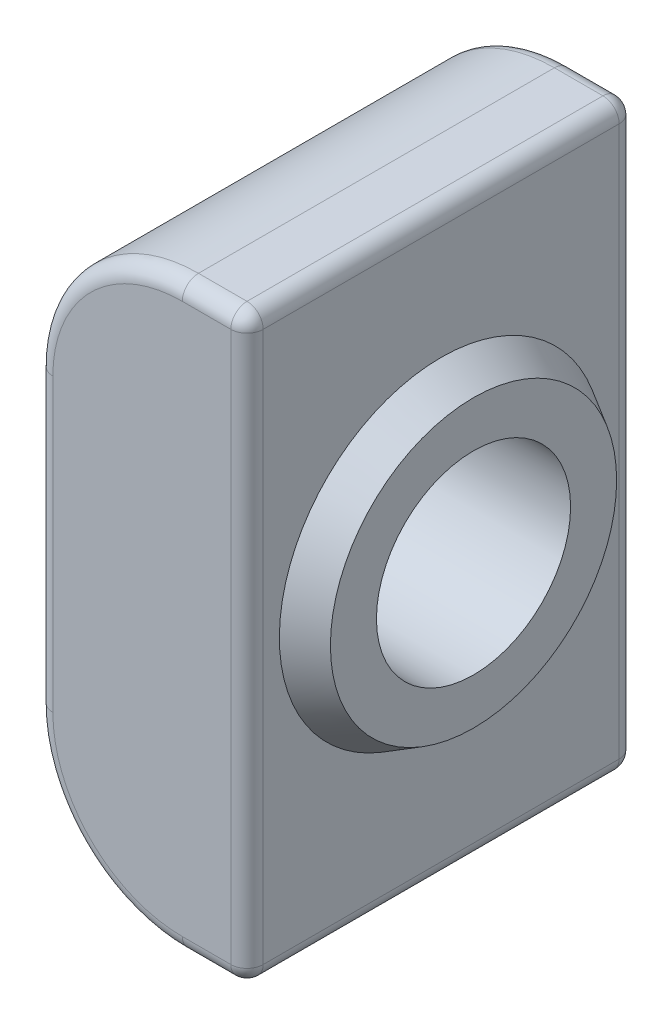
ISO-10303-21;
HEADER;
FILE_DESCRIPTION(('STEP AP214'),'2;1');
FILE_NAME('part.step','',(''),(''),'','','');
FILE_SCHEMA(('AUTOMOTIVE_DESIGN { 1 0 10303 214 1 1 1 1 }'));
ENDSEC;
DATA;
#1=APPLICATION_CONTEXT('core data for automotive mechanical design processes');
#2=APPLICATION_PROTOCOL_DEFINITION('international standard','automotive_design',2000,#1);
#3=PRODUCT_CONTEXT('',#1,'mechanical');
#4=PRODUCT('Part','Part','',(#3));
#5=PRODUCT_RELATED_PRODUCT_CATEGORY('part','',(#4));
#6=PRODUCT_DEFINITION_FORMATION('','',#4);
#7=PRODUCT_DEFINITION_CONTEXT('part definition',#1,'design');
#8=PRODUCT_DEFINITION('design','',#6,#7);
#9=PRODUCT_DEFINITION_SHAPE('','',#8);
#10=(LENGTH_UNIT() NAMED_UNIT(*) SI_UNIT(.MILLI.,.METRE.));
#11=(NAMED_UNIT(*) PLANE_ANGLE_UNIT() SI_UNIT($,.RADIAN.));
#12=(NAMED_UNIT(*) SI_UNIT($,.STERADIAN.) SOLID_ANGLE_UNIT());
#13=UNCERTAINTY_MEASURE_WITH_UNIT(LENGTH_MEASURE(1.E-05),#10,'distance_accuracy_value','');
#14=(GEOMETRIC_REPRESENTATION_CONTEXT(3) GLOBAL_UNCERTAINTY_ASSIGNED_CONTEXT((#13)) GLOBAL_UNIT_ASSIGNED_CONTEXT((#10,
#11,#12)) REPRESENTATION_CONTEXT('',''));
#15=CARTESIAN_POINT('',(0.,0.,0.));
#16=DIRECTION('',(0.,0.,1.));
#17=DIRECTION('',(1.,0.,0.));
#18=AXIS2_PLACEMENT_3D('',#15,#16,#17);
#19=CARTESIAN_POINT('',(0.,9.,6.));
#20=DIRECTION('',(-1.,0.,0.));
#21=DIRECTION('',(0.,0.,1.));
#22=AXIS2_PLACEMENT_3D('',#19,#20,#21);
#23=PLANE('',#22);
#24=DIRECTION('',(0.,1.,0.));
#25=VECTOR('',#24,1.);
#26=CARTESIAN_POINT('',(0.,9.,5.5));
#27=LINE('',#26,#25);
#28=CARTESIAN_POINT('',(0.,8.5,5.5));
#29=VERTEX_POINT('',#28);
#30=CARTESIAN_POINT('',(0.,-8.5,5.5));
#31=VERTEX_POINT('',#30);
#32=EDGE_CURVE('E205',#29,#31,#27,.F.);
#33=ORIENTED_EDGE('',*,*,#32,.T.);
#34=DIRECTION('',(0.,0.,-1.));
#35=VECTOR('',#34,1.);
#36=CARTESIAN_POINT('',(0.,-8.5,6.));
#37=LINE('',#36,#35);
#38=CARTESIAN_POINT('',(0.,-8.5,-5.5));
#39=VERTEX_POINT('',#38);
#40=EDGE_CURVE('E210',#31,#39,#37,.T.);
#41=ORIENTED_EDGE('',*,*,#40,.T.);
#42=DIRECTION('',(0.,1.,0.));
#43=VECTOR('',#42,1.);
#44=CARTESIAN_POINT('',(0.,9.,-5.5));
#45=LINE('',#44,#43);
#46=CARTESIAN_POINT('',(0.,8.5,-5.5));
#47=VERTEX_POINT('',#46);
#48=EDGE_CURVE('E207',#39,#47,#45,.T.);
#49=ORIENTED_EDGE('',*,*,#48,.T.);
#50=DIRECTION('',(0.,0.,-1.));
#51=VECTOR('',#50,1.);
#52=CARTESIAN_POINT('',(0.,8.5,6.));
#53=LINE('',#52,#51);
#54=EDGE_CURVE('E203',#47,#29,#53,.F.);
#55=ORIENTED_EDGE('',*,*,#54,.T.);
#56=EDGE_LOOP('',(#33,#41,#49,#55));
#57=FACE_BOUND('',#56,.T.);
#58=CARTESIAN_POINT('',(0.,0.,0.));
#59=DIRECTION('',(1.,0.,0.));
#60=DIRECTION('',(0.,1.,0.));
#61=AXIS2_PLACEMENT_3D('',#58,#59,#60);
#62=CIRCLE('',#61,5.);
#63=CARTESIAN_POINT('',(0.,5.,0.));
#64=VERTEX_POINT('',#63);
#65=EDGE_CURVE('E155',#64,#64,#62,.T.);
#66=ORIENTED_EDGE('',*,*,#65,.F.);
#67=EDGE_LOOP('',(#66));
#68=FACE_BOUND('',#67,.T.);
#69=ADVANCED_FACE('F33',(#57,#68),#23,.F.);
#70=CARTESIAN_POINT('',(0.,9.,6.));
#71=DIRECTION('',(0.,-1.,0.));
#72=DIRECTION('',(0.,0.,-1.));
#73=AXIS2_PLACEMENT_3D('',#70,#71,#72);
#74=PLANE('',#73);
#75=DIRECTION('',(0.,0.,-1.));
#76=VECTOR('',#75,1.);
#77=CARTESIAN_POINT('',(-0.499999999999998,9.,6.));
#78=LINE('',#77,#76);
#79=CARTESIAN_POINT('',(-0.499999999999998,9.,5.5));
#80=VERTEX_POINT('',#79);
#81=CARTESIAN_POINT('',(-0.499999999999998,9.,-5.5));
#82=VERTEX_POINT('',#81);
#83=EDGE_CURVE('E171',#80,#82,#78,.T.);
#84=ORIENTED_EDGE('',*,*,#83,.T.);
#85=DIRECTION('',(-1.,0.,0.));
#86=VECTOR('',#85,1.);
#87=CARTESIAN_POINT('',(-2.,9.,-5.5));
#88=LINE('',#87,#86);
#89=CARTESIAN_POINT('',(-2.,9.,-5.5));
#90=VERTEX_POINT('',#89);
#91=EDGE_CURVE('E154',#82,#90,#88,.T.);
#92=ORIENTED_EDGE('',*,*,#91,.T.);
#93=DIRECTION('',(0.,0.,-1.));
#94=VECTOR('',#93,1.);
#95=CARTESIAN_POINT('',(-2.,9.,6.));
#96=LINE('',#95,#94);
#97=CARTESIAN_POINT('',(-2.,9.,5.5));
#98=VERTEX_POINT('',#97);
#99=EDGE_CURVE('E137',#98,#90,#96,.T.);
#100=ORIENTED_EDGE('',*,*,#99,.F.);
#101=DIRECTION('',(-1.,0.,0.));
#102=VECTOR('',#101,1.);
#103=CARTESIAN_POINT('',(0.,9.,5.5));
#104=LINE('',#103,#102);
#105=EDGE_CURVE('E151',#98,#80,#104,.F.);
#106=ORIENTED_EDGE('',*,*,#105,.T.);
#107=EDGE_LOOP('',(#84,#92,#100,#106));
#108=FACE_BOUND('',#107,.T.);
#109=ADVANCED_FACE('F149',(#108),#74,.F.);
#110=CARTESIAN_POINT('',(-2.,4.5,6.));
#111=DIRECTION('',(0.,0.,-1.));
#112=DIRECTION('',(-1.,0.,0.));
#113=AXIS2_PLACEMENT_3D('',#110,#111,#112);
#114=CYLINDRICAL_SURFACE('',#113,4.5);
#115=ORIENTED_EDGE('',*,*,#99,.T.);
#116=CARTESIAN_POINT('',(-2.,4.5,-5.5));
#117=DIRECTION('',(0.,0.,-1.));
#118=DIRECTION('',(-1.,0.,0.));
#119=AXIS2_PLACEMENT_3D('',#116,#117,#118);
#120=CIRCLE('',#119,4.5);
#121=CARTESIAN_POINT('',(-6.5,4.5,-5.5));
#122=VERTEX_POINT('',#121);
#123=EDGE_CURVE('E144',#90,#122,#120,.F.);
#124=ORIENTED_EDGE('',*,*,#123,.T.);
#125=DIRECTION('',(0.,0.,-1.));
#126=VECTOR('',#125,1.);
#127=CARTESIAN_POINT('',(-6.5,4.5,6.));
#128=LINE('',#127,#126);
#129=CARTESIAN_POINT('',(-6.5,4.5,5.5));
#130=VERTEX_POINT('',#129);
#131=EDGE_CURVE('E139',#130,#122,#128,.T.);
#132=ORIENTED_EDGE('',*,*,#131,.F.);
#133=CARTESIAN_POINT('',(-2.,4.5,5.5));
#134=DIRECTION('',(0.,0.,-1.));
#135=DIRECTION('',(-1.,0.,0.));
#136=AXIS2_PLACEMENT_3D('',#133,#134,#135);
#137=CIRCLE('',#136,4.5);
#138=EDGE_CURVE('E134',#130,#98,#137,.T.);
#139=ORIENTED_EDGE('',*,*,#138,.T.);
#140=EDGE_LOOP('',(#115,#124,#132,#139));
#141=FACE_BOUND('',#140,.T.);
#142=ADVANCED_FACE('F136',(#141),#114,.T.);
#143=CARTESIAN_POINT('',(-6.5,4.5,6.));
#144=DIRECTION('',(1.,0.,0.));
#145=DIRECTION('',(0.,0.,-1.));
#146=AXIS2_PLACEMENT_3D('',#143,#144,#145);
#147=PLANE('',#146);
#148=CARTESIAN_POINT('',(-6.5,0.,0.));
#149=DIRECTION('',(1.,0.,0.));
#150=DIRECTION('',(0.,1.,0.));
#151=AXIS2_PLACEMENT_3D('',#148,#149,#150);
#152=CIRCLE('',#151,3.);
#153=CARTESIAN_POINT('',(-6.5,3.,0.));
#154=VERTEX_POINT('',#153);
#155=EDGE_CURVE('E272',#154,#154,#152,.T.);
#156=ORIENTED_EDGE('',*,*,#155,.T.);
#157=EDGE_LOOP('',(#156));
#158=FACE_BOUND('',#157,.T.);
#159=ORIENTED_EDGE('',*,*,#131,.T.);
#160=DIRECTION('',(0.,-1.,0.));
#161=VECTOR('',#160,1.);
#162=CARTESIAN_POINT('',(-6.5,-4.5,-5.5));
#163=LINE('',#162,#161);
#164=CARTESIAN_POINT('',(-6.5,-4.5,-5.5));
#165=VERTEX_POINT('',#164);
#166=EDGE_CURVE('E191',#122,#165,#163,.T.);
#167=ORIENTED_EDGE('',*,*,#166,.T.);
#168=DIRECTION('',(0.,0.,-1.));
#169=VECTOR('',#168,1.);
#170=CARTESIAN_POINT('',(-6.5,-4.5,6.));
#171=LINE('',#170,#169);
#172=CARTESIAN_POINT('',(-6.5,-4.5,5.5));
#173=VERTEX_POINT('',#172);
#174=EDGE_CURVE('E287',#173,#165,#171,.T.);
#175=ORIENTED_EDGE('',*,*,#174,.F.);
#176=DIRECTION('',(0.,-1.,0.));
#177=VECTOR('',#176,1.);
#178=CARTESIAN_POINT('',(-6.5,4.5,5.5));
#179=LINE('',#178,#177);
#180=EDGE_CURVE('E189',#173,#130,#179,.F.);
#181=ORIENTED_EDGE('',*,*,#180,.T.);
#182=EDGE_LOOP('',(#159,#167,#175,#181));
#183=FACE_BOUND('',#182,.T.);
#184=ADVANCED_FACE('F292',(#158,#183),#147,.F.);
#185=CARTESIAN_POINT('',(-2.,-4.5,6.));
#186=DIRECTION('',(0.,0.,-1.));
#187=DIRECTION('',(-1.,0.,0.));
#188=AXIS2_PLACEMENT_3D('',#185,#186,#187);
#189=CYLINDRICAL_SURFACE('',#188,4.5);
#190=ORIENTED_EDGE('',*,*,#174,.T.);
#191=CARTESIAN_POINT('',(-2.,-4.5,-5.5));
#192=DIRECTION('',(0.,0.,-1.));
#193=DIRECTION('',(-1.,0.,0.));
#194=AXIS2_PLACEMENT_3D('',#191,#192,#193);
#195=CIRCLE('',#194,4.5);
#196=CARTESIAN_POINT('',(-2.,-9.,-5.5));
#197=VERTEX_POINT('',#196);
#198=EDGE_CURVE('E195',#165,#197,#195,.F.);
#199=ORIENTED_EDGE('',*,*,#198,.T.);
#200=DIRECTION('',(0.,0.,-1.));
#201=VECTOR('',#200,1.);
#202=CARTESIAN_POINT('',(-2.,-9.,6.));
#203=LINE('',#202,#201);
#204=CARTESIAN_POINT('',(-2.,-9.,5.5));
#205=VERTEX_POINT('',#204);
#206=EDGE_CURVE('E284',#205,#197,#203,.T.);
#207=ORIENTED_EDGE('',*,*,#206,.F.);
#208=CARTESIAN_POINT('',(-2.,-4.5,5.5));
#209=DIRECTION('',(0.,0.,-1.));
#210=DIRECTION('',(-1.,0.,0.));
#211=AXIS2_PLACEMENT_3D('',#208,#209,#210);
#212=CIRCLE('',#211,4.5);
#213=EDGE_CURVE('E193',#205,#173,#212,.T.);
#214=ORIENTED_EDGE('',*,*,#213,.T.);
#215=EDGE_LOOP('',(#190,#199,#207,#214));
#216=FACE_BOUND('',#215,.T.);
#217=ADVANCED_FACE('F552',(#216),#189,.T.);
#218=CARTESIAN_POINT('',(0.,-9.,6.));
#219=DIRECTION('',(0.,1.,0.));
#220=DIRECTION('',(0.,0.,1.));
#221=AXIS2_PLACEMENT_3D('',#218,#219,#220);
#222=PLANE('',#221);
#223=ORIENTED_EDGE('',*,*,#206,.T.);
#224=DIRECTION('',(1.,0.,0.));
#225=VECTOR('',#224,1.);
#226=CARTESIAN_POINT('',(0.,-9.,-5.5));
#227=LINE('',#226,#225);
#228=CARTESIAN_POINT('',(-0.499999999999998,-9.,-5.5));
#229=VERTEX_POINT('',#228);
#230=EDGE_CURVE('E201',#197,#229,#227,.T.);
#231=ORIENTED_EDGE('',*,*,#230,.T.);
#232=DIRECTION('',(0.,0.,-1.));
#233=VECTOR('',#232,1.);
#234=CARTESIAN_POINT('',(-0.499999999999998,-9.,6.));
#235=LINE('',#234,#233);
#236=CARTESIAN_POINT('',(-0.499999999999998,-9.,5.5));
#237=VERTEX_POINT('',#236);
#238=EDGE_CURVE('E197',#229,#237,#235,.F.);
#239=ORIENTED_EDGE('',*,*,#238,.T.);
#240=DIRECTION('',(1.,0.,0.));
#241=VECTOR('',#240,1.);
#242=CARTESIAN_POINT('',(0.,-9.,5.5));
#243=LINE('',#242,#241);
#244=EDGE_CURVE('E199',#237,#205,#243,.F.);
#245=ORIENTED_EDGE('',*,*,#244,.T.);
#246=EDGE_LOOP('',(#223,#231,#239,#245));
#247=FACE_BOUND('',#246,.T.);
#248=ADVANCED_FACE('F336',(#247),#222,.F.);
#249=CARTESIAN_POINT('',(-2.,-4.5,6.));
#250=DIRECTION('',(0.,0.,-1.));
#251=DIRECTION('',(-1.,0.,0.));
#252=AXIS2_PLACEMENT_3D('',#249,#250,#251);
#253=PLANE('',#252);
#254=CARTESIAN_POINT('',(-2.,-4.5,6.));
#255=DIRECTION('',(0.,0.,-1.));
#256=DIRECTION('',(-1.,0.,0.));
#257=AXIS2_PLACEMENT_3D('',#254,#255,#256);
#258=CIRCLE('',#257,4.);
#259=CARTESIAN_POINT('',(-5.99999999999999,-4.5,6.));
#260=VERTEX_POINT('',#259);
#261=CARTESIAN_POINT('',(-2.,-8.5,6.));
#262=VERTEX_POINT('',#261);
#263=EDGE_CURVE('E42',#260,#262,#258,.F.);
#264=ORIENTED_EDGE('',*,*,#263,.T.);
#265=DIRECTION('',(1.,0.,0.));
#266=VECTOR('',#265,1.);
#267=CARTESIAN_POINT('',(-2.,-8.5,6.));
#268=LINE('',#267,#266);
#269=CARTESIAN_POINT('',(-0.499999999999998,-8.5,6.));
#270=VERTEX_POINT('',#269);
#271=EDGE_CURVE('E11',#262,#270,#268,.T.);
#272=ORIENTED_EDGE('',*,*,#271,.T.);
#273=DIRECTION('',(0.,1.,0.));
#274=VECTOR('',#273,1.);
#275=CARTESIAN_POINT('',(-0.499999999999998,-4.5,6.));
#276=LINE('',#275,#274);
#277=CARTESIAN_POINT('',(-0.499999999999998,8.5,6.));
#278=VERTEX_POINT('',#277);
#279=EDGE_CURVE('E212',#270,#278,#276,.T.);
#280=ORIENTED_EDGE('',*,*,#279,.T.);
#281=DIRECTION('',(-1.,0.,0.));
#282=VECTOR('',#281,1.);
#283=CARTESIAN_POINT('',(-2.,8.5,6.));
#284=LINE('',#283,#282);
#285=CARTESIAN_POINT('',(-2.,8.5,6.));
#286=VERTEX_POINT('',#285);
#287=EDGE_CURVE('E214',#278,#286,#284,.T.);
#288=ORIENTED_EDGE('',*,*,#287,.T.);
#289=CARTESIAN_POINT('',(-2.,4.5,6.));
#290=DIRECTION('',(0.,0.,-1.));
#291=DIRECTION('',(-1.,0.,0.));
#292=AXIS2_PLACEMENT_3D('',#289,#290,#291);
#293=CIRCLE('',#292,4.);
#294=CARTESIAN_POINT('',(-5.99999999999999,4.5,6.));
#295=VERTEX_POINT('',#294);
#296=EDGE_CURVE('E161',#286,#295,#293,.F.);
#297=ORIENTED_EDGE('',*,*,#296,.T.);
#298=DIRECTION('',(0.,-1.,0.));
#299=VECTOR('',#298,1.);
#300=CARTESIAN_POINT('',(-5.99999999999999,-4.5,6.));
#301=LINE('',#300,#299);
#302=EDGE_CURVE('E53',#295,#260,#301,.T.);
#303=ORIENTED_EDGE('',*,*,#302,.T.);
#304=EDGE_LOOP('',(#264,#272,#280,#288,#297,#303));
#305=FACE_BOUND('',#304,.T.);
#306=ADVANCED_FACE('F347',(#305),#253,.F.);
#307=CARTESIAN_POINT('',(-2.,-4.5,-6.));
#308=DIRECTION('',(0.,0.,-1.));
#309=DIRECTION('',(-1.,0.,0.));
#310=AXIS2_PLACEMENT_3D('',#307,#308,#309);
#311=PLANE('',#310);
#312=CARTESIAN_POINT('',(-2.,4.5,-6.));
#313=DIRECTION('',(0.,0.,-1.));
#314=DIRECTION('',(-1.,0.,0.));
#315=AXIS2_PLACEMENT_3D('',#312,#313,#314);
#316=CIRCLE('',#315,4.);
#317=CARTESIAN_POINT('',(-5.99999999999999,4.5,-6.));
#318=VERTEX_POINT('',#317);
#319=CARTESIAN_POINT('',(-2.,8.5,-6.));
#320=VERTEX_POINT('',#319);
#321=EDGE_CURVE('E184',#318,#320,#316,.T.);
#322=ORIENTED_EDGE('',*,*,#321,.T.);
#323=DIRECTION('',(-1.,0.,0.));
#324=VECTOR('',#323,1.);
#325=CARTESIAN_POINT('',(0.,8.5,-6.));
#326=LINE('',#325,#324);
#327=CARTESIAN_POINT('',(-0.499999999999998,8.5,-6.));
#328=VERTEX_POINT('',#327);
#329=EDGE_CURVE('E145',#320,#328,#326,.F.);
#330=ORIENTED_EDGE('',*,*,#329,.T.);
#331=DIRECTION('',(0.,1.,0.));
#332=VECTOR('',#331,1.);
#333=CARTESIAN_POINT('',(-0.499999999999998,-9.,-6.));
#334=LINE('',#333,#332);
#335=CARTESIAN_POINT('',(-0.499999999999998,-8.5,-6.));
#336=VERTEX_POINT('',#335);
#337=EDGE_CURVE('E173',#328,#336,#334,.F.);
#338=ORIENTED_EDGE('',*,*,#337,.T.);
#339=DIRECTION('',(1.,0.,0.));
#340=VECTOR('',#339,1.);
#341=CARTESIAN_POINT('',(-2.,-8.5,-6.));
#342=LINE('',#341,#340);
#343=CARTESIAN_POINT('',(-2.,-8.5,-6.));
#344=VERTEX_POINT('',#343);
#345=EDGE_CURVE('E178',#336,#344,#342,.F.);
#346=ORIENTED_EDGE('',*,*,#345,.T.);
#347=CARTESIAN_POINT('',(-2.,-4.5,-6.));
#348=DIRECTION('',(0.,0.,-1.));
#349=DIRECTION('',(-1.,0.,0.));
#350=AXIS2_PLACEMENT_3D('',#347,#348,#349);
#351=CIRCLE('',#350,4.);
#352=CARTESIAN_POINT('',(-5.99999999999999,-4.5,-6.));
#353=VERTEX_POINT('',#352);
#354=EDGE_CURVE('E180',#344,#353,#351,.T.);
#355=ORIENTED_EDGE('',*,*,#354,.T.);
#356=DIRECTION('',(0.,-1.,0.));
#357=VECTOR('',#356,1.);
#358=CARTESIAN_POINT('',(-5.99999999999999,4.5,-6.));
#359=LINE('',#358,#357);
#360=EDGE_CURVE('E182',#353,#318,#359,.F.);
#361=ORIENTED_EDGE('',*,*,#360,.T.);
#362=EDGE_LOOP('',(#322,#330,#338,#346,#355,#361));
#363=FACE_BOUND('',#362,.T.);
#364=ADVANCED_FACE('F306',(#363),#311,.T.);
#365=CARTESIAN_POINT('',(0.,0.,0.));
#366=DIRECTION('',(-1.,0.,0.));
#367=DIRECTION('',(0.,1.,0.));
#368=AXIS2_PLACEMENT_3D('',#365,#366,#367);
#369=CONICAL_SURFACE('',#368,5.,0.5235987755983);
#370=CARTESIAN_POINT('',(1.,0.,0.));
#371=DIRECTION('',(1.,0.,0.));
#372=DIRECTION('',(0.,1.,0.));
#373=AXIS2_PLACEMENT_3D('',#370,#371,#372);
#374=CIRCLE('',#373,4.42264973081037);
#375=CARTESIAN_POINT('',(1.,4.42264973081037,0.));
#376=VERTEX_POINT('',#375);
#377=EDGE_CURVE('E277',#376,#376,#374,.T.);
#378=ORIENTED_EDGE('',*,*,#377,.F.);
#379=EDGE_LOOP('',(#378));
#380=FACE_BOUND('',#379,.T.);
#381=ORIENTED_EDGE('',*,*,#65,.T.);
#382=EDGE_LOOP('',(#381));
#383=FACE_BOUND('',#382,.T.);
#384=ADVANCED_FACE('F522',(#380,#383),#369,.T.);
#385=CARTESIAN_POINT('',(1.,0.,0.));
#386=DIRECTION('',(1.,0.,0.));
#387=DIRECTION('',(0.,1.,0.));
#388=AXIS2_PLACEMENT_3D('',#385,#386,#387);
#389=PLANE('',#388);
#390=CARTESIAN_POINT('',(1.,0.,0.));
#391=DIRECTION('',(1.,0.,0.));
#392=DIRECTION('',(0.,1.,0.));
#393=AXIS2_PLACEMENT_3D('',#390,#391,#392);
#394=CIRCLE('',#393,3.);
#395=CARTESIAN_POINT('',(1.,3.,0.));
#396=VERTEX_POINT('',#395);
#397=EDGE_CURVE('E267',#396,#396,#394,.T.);
#398=ORIENTED_EDGE('',*,*,#397,.F.);
#399=EDGE_LOOP('',(#398));
#400=FACE_BOUND('',#399,.T.);
#401=ORIENTED_EDGE('',*,*,#377,.T.);
#402=EDGE_LOOP('',(#401));
#403=FACE_BOUND('',#402,.T.);
#404=ADVANCED_FACE('F513',(#400,#403),#389,.T.);
#405=CARTESIAN_POINT('',(-6.5,0.,0.));
#406=DIRECTION('',(1.,0.,0.));
#407=DIRECTION('',(0.,1.,0.));
#408=AXIS2_PLACEMENT_3D('',#405,#406,#407);
#409=CYLINDRICAL_SURFACE('',#408,3.);
#410=CARTESIAN_POINT('',(-6.5,3.,0.));
#411=CARTESIAN_POINT('',(-6.421875,3.,0.));
#412=CARTESIAN_POINT('',(-6.34375,3.,0.));
#413=CARTESIAN_POINT('',(-6.1875,3.,0.));
#414=CARTESIAN_POINT('',(-6.109375,3.,0.));
#415=CARTESIAN_POINT('',(-5.953125,3.,0.));
#416=CARTESIAN_POINT('',(-5.875,3.,0.));
#417=CARTESIAN_POINT('',(-5.71875,3.,0.));
#418=CARTESIAN_POINT('',(-5.640625,3.,0.));
#419=CARTESIAN_POINT('',(-5.484375,3.,0.));
#420=CARTESIAN_POINT('',(-5.40625,3.,0.));
#421=CARTESIAN_POINT('',(-5.25,3.,0.));
#422=CARTESIAN_POINT('',(-5.171875,3.,0.));
#423=CARTESIAN_POINT('',(-5.015625,3.,0.));
#424=CARTESIAN_POINT('',(-4.9375,3.,0.));
#425=CARTESIAN_POINT('',(-4.78125,3.,0.));
#426=CARTESIAN_POINT('',(-4.703125,3.,0.));
#427=CARTESIAN_POINT('',(-4.546875,3.,0.));
#428=CARTESIAN_POINT('',(-4.46875,3.,0.));
#429=CARTESIAN_POINT('',(-4.3125,3.,0.));
#430=CARTESIAN_POINT('',(-4.234375,3.,0.));
#431=CARTESIAN_POINT('',(-4.078125,3.,0.));
#432=CARTESIAN_POINT('',(-4.,3.,0.));
#433=CARTESIAN_POINT('',(-3.84375,3.,0.));
#434=CARTESIAN_POINT('',(-3.765625,3.,0.));
#435=CARTESIAN_POINT('',(-3.609375,3.,0.));
#436=CARTESIAN_POINT('',(-3.53125,3.,0.));
#437=CARTESIAN_POINT('',(-3.375,3.,0.));
#438=CARTESIAN_POINT('',(-3.296875,3.,0.));
#439=CARTESIAN_POINT('',(-3.140625,3.,0.));
#440=CARTESIAN_POINT('',(-3.0625,3.,0.));
#441=CARTESIAN_POINT('',(-2.90625,3.,0.));
#442=CARTESIAN_POINT('',(-2.828125,3.,0.));
#443=CARTESIAN_POINT('',(-2.671875,3.,0.));
#444=CARTESIAN_POINT('',(-2.59375,3.,0.));
#445=CARTESIAN_POINT('',(-2.4375,3.,0.));
#446=CARTESIAN_POINT('',(-2.359375,3.,0.));
#447=CARTESIAN_POINT('',(-2.203125,3.,0.));
#448=CARTESIAN_POINT('',(-2.125,3.,0.));
#449=CARTESIAN_POINT('',(-1.96875,3.,0.));
#450=CARTESIAN_POINT('',(-1.890625,3.,0.));
#451=CARTESIAN_POINT('',(-1.734375,3.,0.));
#452=CARTESIAN_POINT('',(-1.65625,3.,0.));
#453=CARTESIAN_POINT('',(-1.5,3.,0.));
#454=CARTESIAN_POINT('',(-1.421875,3.,0.));
#455=CARTESIAN_POINT('',(-1.265625,3.,0.));
#456=CARTESIAN_POINT('',(-1.1875,3.,0.));
#457=CARTESIAN_POINT('',(-1.03125,3.,0.));
#458=CARTESIAN_POINT('',(-0.953125,3.,0.));
#459=CARTESIAN_POINT('',(-0.796875,3.,0.));
#460=CARTESIAN_POINT('',(-0.71875,3.,0.));
#461=CARTESIAN_POINT('',(-0.5625,3.,0.));
#462=CARTESIAN_POINT('',(-0.484375,3.,0.));
#463=CARTESIAN_POINT('',(-0.328124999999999,3.,0.));
#464=CARTESIAN_POINT('',(-0.249999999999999,3.,0.));
#465=CARTESIAN_POINT('',(-0.0937499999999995,3.,0.));
#466=CARTESIAN_POINT('',(-0.0156249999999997,3.,0.));
#467=CARTESIAN_POINT('',(0.140625,3.,0.));
#468=CARTESIAN_POINT('',(0.21875,3.,0.));
#469=CARTESIAN_POINT('',(0.375,3.,0.));
#470=CARTESIAN_POINT('',(0.453125,3.,0.));
#471=CARTESIAN_POINT('',(0.609375,3.,0.));
#472=CARTESIAN_POINT('',(0.6875,3.,0.));
#473=CARTESIAN_POINT('',(0.84375,3.,0.));
#474=CARTESIAN_POINT('',(0.921875,3.,0.));
#475=CARTESIAN_POINT('',(1.,3.,0.));
#476=B_SPLINE_CURVE_WITH_KNOTS('',3,(#410,#411,#412,#413,#414,#415,#416,#417,#418,#419,#420,
#421,#422,#423,#424,#425,#426,#427,#428,#429,#430,#431,#432,#433,#434,#435,#436,#437,#438,#439,
#440,#441,#442,#443,#444,#445,#446,#447,#448,#449,#450,#451,#452,#453,#454,#455,#456,#457,#458,
#459,#460,#461,#462,#463,#464,#465,#466,#467,#468,#469,#470,#471,#472,#473,#474,#475),
.UNSPECIFIED.,.F.,.F.,(4,2,2,2,2,2,2,2,2,2,2,2,2,2,2,2,2,2,2,2,2,2,2,2,2,2,2,2,2,2,2,2,4),(0.,
0.234375,0.46875,0.703125,0.9375,1.171875,1.40625,1.640625,1.875,2.109375,2.34375,2.578125,
2.8125,3.046875,3.28125,3.515625,3.75,3.984375,4.21875,4.453125,4.6875,4.921875,5.15625,
5.390625,5.625,5.859375,6.09375,6.328125,6.5625,6.796875,7.03125,7.265625,7.5),.UNSPECIFIED.);
#477=EDGE_CURVE('BSEAM504',#154,#396,#476,.T.);
#478=ORIENTED_EDGE('',*,*,#155,.F.);
#479=ORIENTED_EDGE('',*,*,#397,.T.);
#480=ORIENTED_EDGE('',*,*,#477,.T.);
#481=ORIENTED_EDGE('',*,*,#477,.F.);
#482=EDGE_LOOP('',(#478,#480,#479,#481));
#483=FACE_BOUND('',#482,.T.);
#484=ADVANCED_FACE('F504',(#483),#409,.F.);
#485=CARTESIAN_POINT('',(-2.,-4.5,5.5));
#486=DIRECTION('',(0.,0.,-1.));
#487=DIRECTION('',(-1.,0.,0.));
#488=AXIS2_PLACEMENT_3D('',#485,#486,#487);
#489=TOROIDAL_SURFACE('',#488,4.,0.5);
#490=CARTESIAN_POINT('',(-5.99999999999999,-4.5,5.5));
#491=DIRECTION('',(0.,1.,0.));
#492=DIRECTION('',(0.,0.,1.));
#493=AXIS2_PLACEMENT_3D('',#490,#491,#492);
#494=CIRCLE('',#493,0.5);
#495=EDGE_CURVE('E261',#173,#260,#494,.T.);
#496=ORIENTED_EDGE('',*,*,#495,.F.);
#497=ORIENTED_EDGE('',*,*,#213,.F.);
#498=CARTESIAN_POINT('',(-2.,-8.5,5.5));
#499=DIRECTION('',(1.,0.,0.));
#500=DIRECTION('',(0.,0.,-1.));
#501=AXIS2_PLACEMENT_3D('',#498,#499,#500);
#502=CIRCLE('',#501,0.5);
#503=EDGE_CURVE('E37',#262,#205,#502,.T.);
#504=ORIENTED_EDGE('',*,*,#503,.F.);
#505=ORIENTED_EDGE('',*,*,#263,.F.);
#506=EDGE_LOOP('',(#496,#497,#504,#505));
#507=FACE_BOUND('',#506,.T.);
#508=ADVANCED_FACE('F35',(#507),#489,.T.);
#509=CARTESIAN_POINT('',(-2.,-8.5,5.5));
#510=DIRECTION('',(1.,0.,0.));
#511=DIRECTION('',(0.,0.,-1.));
#512=AXIS2_PLACEMENT_3D('',#509,#510,#511);
#513=CYLINDRICAL_SURFACE('',#512,0.5);
#514=ORIENTED_EDGE('',*,*,#503,.T.);
#515=ORIENTED_EDGE('',*,*,#244,.F.);
#516=CARTESIAN_POINT('',(-0.499999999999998,-8.5,5.5));
#517=DIRECTION('',(1.,0.,0.));
#518=DIRECTION('',(0.,1.,0.));
#519=AXIS2_PLACEMENT_3D('',#516,#517,#518);
#520=CIRCLE('',#519,0.5);
#521=EDGE_CURVE('E259',#270,#237,#520,.T.);
#522=ORIENTED_EDGE('',*,*,#521,.F.);
#523=ORIENTED_EDGE('',*,*,#271,.F.);
#524=EDGE_LOOP('',(#514,#515,#522,#523));
#525=FACE_BOUND('',#524,.T.);
#526=ADVANCED_FACE('F339',(#525),#513,.T.);
#527=CARTESIAN_POINT('',(-5.99999999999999,-4.5,5.5));
#528=DIRECTION('',(0.,-1.,0.));
#529=DIRECTION('',(0.,0.,-1.));
#530=AXIS2_PLACEMENT_3D('',#527,#528,#529);
#531=CYLINDRICAL_SURFACE('',#530,0.5);
#532=ORIENTED_EDGE('',*,*,#495,.T.);
#533=ORIENTED_EDGE('',*,*,#302,.F.);
#534=CARTESIAN_POINT('',(-5.99999999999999,4.5,5.5));
#535=DIRECTION('',(0.,1.,0.));
#536=DIRECTION('',(0.,0.,1.));
#537=AXIS2_PLACEMENT_3D('',#534,#535,#536);
#538=CIRCLE('',#537,0.5);
#539=EDGE_CURVE('E257',#130,#295,#538,.T.);
#540=ORIENTED_EDGE('',*,*,#539,.F.);
#541=ORIENTED_EDGE('',*,*,#180,.F.);
#542=EDGE_LOOP('',(#532,#533,#540,#541));
#543=FACE_BOUND('',#542,.T.);
#544=ADVANCED_FACE('F348',(#543),#531,.T.);
#545=CARTESIAN_POINT('',(-0.499999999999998,-8.5,5.5));
#546=DIRECTION('',(0.,-1.,0.));
#547=DIRECTION('',(0.,0.,-1.));
#548=AXIS2_PLACEMENT_3D('',#545,#546,#547);
#549=SPHERICAL_SURFACE('',#548,0.5);
#550=CARTESIAN_POINT('',(-0.499999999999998,-8.5,5.5));
#551=DIRECTION('',(0.,-1.,0.));
#552=DIRECTION('',(0.,0.,-1.));
#553=AXIS2_PLACEMENT_3D('',#550,#551,#552);
#554=CIRCLE('',#553,0.5);
#555=EDGE_CURVE('E164',#270,#31,#554,.F.);
#556=ORIENTED_EDGE('',*,*,#555,.F.);
#557=ORIENTED_EDGE('',*,*,#521,.T.);
#558=CARTESIAN_POINT('',(-0.499999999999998,-8.5,5.5));
#559=DIRECTION('',(0.,0.,1.));
#560=DIRECTION('',(1.,0.,0.));
#561=AXIS2_PLACEMENT_3D('',#558,#559,#560);
#562=CIRCLE('',#561,0.5);
#563=EDGE_CURVE('E254',#31,#237,#562,.F.);
#564=ORIENTED_EDGE('',*,*,#563,.F.);
#565=EDGE_LOOP('',(#556,#557,#564));
#566=FACE_BOUND('',#565,.T.);
#567=ADVANCED_FACE('F342',(#566),#549,.T.);
#568=CARTESIAN_POINT('',(-2.,4.5,5.5));
#569=DIRECTION('',(0.,0.,-1.));
#570=DIRECTION('',(-1.,0.,0.));
#571=AXIS2_PLACEMENT_3D('',#568,#569,#570);
#572=TOROIDAL_SURFACE('',#571,4.,0.5);
#573=ORIENTED_EDGE('',*,*,#539,.T.);
#574=ORIENTED_EDGE('',*,*,#296,.F.);
#575=CARTESIAN_POINT('',(-2.,8.5,5.5));
#576=DIRECTION('',(1.,0.,0.));
#577=DIRECTION('',(0.,0.,-1.));
#578=AXIS2_PLACEMENT_3D('',#575,#576,#577);
#579=CIRCLE('',#578,0.5);
#580=EDGE_CURVE('E159',#98,#286,#579,.T.);
#581=ORIENTED_EDGE('',*,*,#580,.F.);
#582=ORIENTED_EDGE('',*,*,#138,.F.);
#583=EDGE_LOOP('',(#573,#574,#581,#582));
#584=FACE_BOUND('',#583,.T.);
#585=ADVANCED_FACE('F160',(#584),#572,.T.);
#586=CARTESIAN_POINT('',(-0.499999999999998,-8.5,6.));
#587=DIRECTION('',(0.,0.,-1.));
#588=DIRECTION('',(-1.,0.,0.));
#589=AXIS2_PLACEMENT_3D('',#586,#587,#588);
#590=CYLINDRICAL_SURFACE('',#589,0.5);
#591=ORIENTED_EDGE('',*,*,#563,.T.);
#592=ORIENTED_EDGE('',*,*,#238,.F.);
#593=CARTESIAN_POINT('',(-0.499999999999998,-8.5,-5.5));
#594=DIRECTION('',(0.,0.,-1.));
#595=DIRECTION('',(-1.,0.,0.));
#596=AXIS2_PLACEMENT_3D('',#593,#594,#595);
#597=CIRCLE('',#596,0.5);
#598=EDGE_CURVE('E247',#39,#229,#597,.T.);
#599=ORIENTED_EDGE('',*,*,#598,.F.);
#600=ORIENTED_EDGE('',*,*,#40,.F.);
#601=EDGE_LOOP('',(#591,#592,#599,#600));
#602=FACE_BOUND('',#601,.T.);
#603=ADVANCED_FACE('F333',(#602),#590,.T.);
#604=CARTESIAN_POINT('',(-0.499999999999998,-4.5,5.5));
#605=DIRECTION('',(0.,1.,0.));
#606=DIRECTION('',(0.,0.,1.));
#607=AXIS2_PLACEMENT_3D('',#604,#605,#606);
#608=CYLINDRICAL_SURFACE('',#607,0.5);
#609=ORIENTED_EDGE('',*,*,#555,.T.);
#610=ORIENTED_EDGE('',*,*,#32,.F.);
#611=CARTESIAN_POINT('',(-0.499999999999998,8.5,5.5));
#612=DIRECTION('',(0.,1.,0.));
#613=DIRECTION('',(-1.,0.,0.));
#614=AXIS2_PLACEMENT_3D('',#611,#612,#613);
#615=CIRCLE('',#614,0.5);
#616=EDGE_CURVE('E244',#278,#29,#615,.T.);
#617=ORIENTED_EDGE('',*,*,#616,.F.);
#618=ORIENTED_EDGE('',*,*,#279,.F.);
#619=EDGE_LOOP('',(#609,#610,#617,#618));
#620=FACE_BOUND('',#619,.T.);
#621=ADVANCED_FACE('F345',(#620),#608,.T.);
#622=CARTESIAN_POINT('',(-2.,8.5,5.5));
#623=DIRECTION('',(-1.,0.,0.));
#624=DIRECTION('',(0.,0.,1.));
#625=AXIS2_PLACEMENT_3D('',#622,#623,#624);
#626=CYLINDRICAL_SURFACE('',#625,0.5);
#627=ORIENTED_EDGE('',*,*,#580,.T.);
#628=ORIENTED_EDGE('',*,*,#287,.F.);
#629=CARTESIAN_POINT('',(-0.499999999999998,8.5,5.5));
#630=DIRECTION('',(1.,0.,0.));
#631=DIRECTION('',(0.,0.,-1.));
#632=AXIS2_PLACEMENT_3D('',#629,#630,#631);
#633=CIRCLE('',#632,0.5);
#634=EDGE_CURVE('E169',#80,#278,#633,.T.);
#635=ORIENTED_EDGE('',*,*,#634,.F.);
#636=ORIENTED_EDGE('',*,*,#105,.F.);
#637=EDGE_LOOP('',(#627,#628,#635,#636));
#638=FACE_BOUND('',#637,.T.);
#639=ADVANCED_FACE('F167',(#638),#626,.T.);
#640=CARTESIAN_POINT('',(0.,-8.5,-5.5));
#641=DIRECTION('',(-1.,0.,0.));
#642=DIRECTION('',(0.,0.,1.));
#643=AXIS2_PLACEMENT_3D('',#640,#641,#642);
#644=CYLINDRICAL_SURFACE('',#643,0.5);
#645=CARTESIAN_POINT('',(-0.499999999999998,-8.5,-5.5));
#646=DIRECTION('',(1.,0.,0.));
#647=DIRECTION('',(0.,0.,-1.));
#648=AXIS2_PLACEMENT_3D('',#645,#646,#647);
#649=CIRCLE('',#648,0.5);
#650=EDGE_CURVE('E165',#229,#336,#649,.T.);
#651=ORIENTED_EDGE('',*,*,#650,.F.);
#652=ORIENTED_EDGE('',*,*,#230,.F.);
#653=CARTESIAN_POINT('',(-2.,-8.5,-5.5));
#654=DIRECTION('',(-1.,0.,0.));
#655=DIRECTION('',(0.,0.,1.));
#656=AXIS2_PLACEMENT_3D('',#653,#654,#655);
#657=CIRCLE('',#656,0.5);
#658=EDGE_CURVE('E240',#344,#197,#657,.T.);
#659=ORIENTED_EDGE('',*,*,#658,.F.);
#660=ORIENTED_EDGE('',*,*,#345,.F.);
#661=EDGE_LOOP('',(#651,#652,#659,#660));
#662=FACE_BOUND('',#661,.T.);
#663=ADVANCED_FACE('F324',(#662),#644,.T.);
#664=CARTESIAN_POINT('',(-0.499999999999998,-8.5,-5.5));
#665=DIRECTION('',(0.,-1.,0.));
#666=DIRECTION('',(0.,0.,-1.));
#667=AXIS2_PLACEMENT_3D('',#664,#665,#666);
#668=SPHERICAL_SURFACE('',#667,0.5);
#669=ORIENTED_EDGE('',*,*,#598,.T.);
#670=ORIENTED_EDGE('',*,*,#650,.T.);
#671=CARTESIAN_POINT('',(-0.499999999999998,-8.5,-5.5));
#672=DIRECTION('',(0.,-1.,0.));
#673=DIRECTION('',(0.,0.,-1.));
#674=AXIS2_PLACEMENT_3D('',#671,#672,#673);
#675=CIRCLE('',#674,0.5);
#676=EDGE_CURVE('E237',#39,#336,#675,.F.);
#677=ORIENTED_EDGE('',*,*,#676,.F.);
#678=EDGE_LOOP('',(#669,#670,#677));
#679=FACE_BOUND('',#678,.T.);
#680=ADVANCED_FACE('F328',(#679),#668,.T.);
#681=CARTESIAN_POINT('',(-0.499999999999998,8.5,5.5));
#682=DIRECTION('',(0.,0.,1.));
#683=DIRECTION('',(0.,-1.,0.));
#684=AXIS2_PLACEMENT_3D('',#681,#682,#683);
#685=SPHERICAL_SURFACE('',#684,0.5);
#686=ORIENTED_EDGE('',*,*,#634,.T.);
#687=ORIENTED_EDGE('',*,*,#616,.T.);
#688=CARTESIAN_POINT('',(-0.499999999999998,8.5,5.5));
#689=DIRECTION('',(0.,0.,1.));
#690=DIRECTION('',(1.,0.,0.));
#691=AXIS2_PLACEMENT_3D('',#688,#689,#690);
#692=CIRCLE('',#691,0.5);
#693=EDGE_CURVE('E234',#80,#29,#692,.F.);
#694=ORIENTED_EDGE('',*,*,#693,.F.);
#695=EDGE_LOOP('',(#686,#687,#694));
#696=FACE_BOUND('',#695,.T.);
#697=ADVANCED_FACE('F383',(#696),#685,.T.);
#698=CARTESIAN_POINT('',(-2.,-4.5,-5.5));
#699=DIRECTION('',(0.,0.,-1.));
#700=DIRECTION('',(-1.,0.,0.));
#701=AXIS2_PLACEMENT_3D('',#698,#699,#700);
#702=TOROIDAL_SURFACE('',#701,4.,0.5);
#703=ORIENTED_EDGE('',*,*,#658,.T.);
#704=ORIENTED_EDGE('',*,*,#198,.F.);
#705=CARTESIAN_POINT('',(-5.99999999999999,-4.5,-5.5));
#706=DIRECTION('',(0.,1.,0.));
#707=DIRECTION('',(0.,0.,1.));
#708=AXIS2_PLACEMENT_3D('',#705,#706,#707);
#709=CIRCLE('',#708,0.5);
#710=EDGE_CURVE('E231',#353,#165,#709,.T.);
#711=ORIENTED_EDGE('',*,*,#710,.F.);
#712=ORIENTED_EDGE('',*,*,#354,.F.);
#713=EDGE_LOOP('',(#703,#704,#711,#712));
#714=FACE_BOUND('',#713,.T.);
#715=ADVANCED_FACE('F380',(#714),#702,.T.);
#716=CARTESIAN_POINT('',(-0.499999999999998,9.,-5.5));
#717=DIRECTION('',(0.,-1.,0.));
#718=DIRECTION('',(0.,0.,-1.));
#719=AXIS2_PLACEMENT_3D('',#716,#717,#718);
#720=CYLINDRICAL_SURFACE('',#719,0.5);
#721=ORIENTED_EDGE('',*,*,#676,.T.);
#722=ORIENTED_EDGE('',*,*,#337,.F.);
#723=CARTESIAN_POINT('',(-0.499999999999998,8.5,-5.5));
#724=DIRECTION('',(0.,1.,0.));
#725=DIRECTION('',(0.,0.,1.));
#726=AXIS2_PLACEMENT_3D('',#723,#724,#725);
#727=CIRCLE('',#726,0.5);
#728=EDGE_CURVE('E228',#47,#328,#727,.T.);
#729=ORIENTED_EDGE('',*,*,#728,.F.);
#730=ORIENTED_EDGE('',*,*,#48,.F.);
#731=EDGE_LOOP('',(#721,#722,#729,#730));
#732=FACE_BOUND('',#731,.T.);
#733=ADVANCED_FACE('F318',(#732),#720,.T.);
#734=CARTESIAN_POINT('',(-0.499999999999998,8.5,6.));
#735=DIRECTION('',(0.,0.,-1.));
#736=DIRECTION('',(-1.,0.,0.));
#737=AXIS2_PLACEMENT_3D('',#734,#735,#736);
#738=CYLINDRICAL_SURFACE('',#737,0.5);
#739=ORIENTED_EDGE('',*,*,#693,.T.);
#740=ORIENTED_EDGE('',*,*,#54,.F.);
#741=CARTESIAN_POINT('',(-0.499999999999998,8.5,-5.5));
#742=DIRECTION('',(0.,0.,-1.));
#743=DIRECTION('',(-1.,0.,0.));
#744=AXIS2_PLACEMENT_3D('',#741,#742,#743);
#745=CIRCLE('',#744,0.5);
#746=EDGE_CURVE('E226',#82,#47,#745,.T.);
#747=ORIENTED_EDGE('',*,*,#746,.F.);
#748=ORIENTED_EDGE('',*,*,#83,.F.);
#749=EDGE_LOOP('',(#739,#740,#747,#748));
#750=FACE_BOUND('',#749,.T.);
#751=ADVANCED_FACE('F374',(#750),#738,.T.);
#752=CARTESIAN_POINT('',(-5.99999999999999,4.5,-5.5));
#753=DIRECTION('',(0.,1.,0.));
#754=DIRECTION('',(0.,0.,1.));
#755=AXIS2_PLACEMENT_3D('',#752,#753,#754);
#756=CYLINDRICAL_SURFACE('',#755,0.5);
#757=ORIENTED_EDGE('',*,*,#710,.T.);
#758=ORIENTED_EDGE('',*,*,#166,.F.);
#759=CARTESIAN_POINT('',(-5.99999999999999,4.5,-5.5));
#760=DIRECTION('',(0.,1.,0.));
#761=DIRECTION('',(0.,0.,1.));
#762=AXIS2_PLACEMENT_3D('',#759,#760,#761);
#763=CIRCLE('',#762,0.5);
#764=EDGE_CURVE('E223',#318,#122,#763,.T.);
#765=ORIENTED_EDGE('',*,*,#764,.F.);
#766=ORIENTED_EDGE('',*,*,#360,.F.);
#767=EDGE_LOOP('',(#757,#758,#765,#766));
#768=FACE_BOUND('',#767,.T.);
#769=ADVANCED_FACE('F296',(#768),#756,.T.);
#770=CARTESIAN_POINT('',(-0.499999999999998,8.5,-5.5));
#771=DIRECTION('',(1.,0.,0.));
#772=DIRECTION('',(0.,0.,-1.));
#773=AXIS2_PLACEMENT_3D('',#770,#771,#772);
#774=SPHERICAL_SURFACE('',#773,0.5);
#775=ORIENTED_EDGE('',*,*,#746,.T.);
#776=ORIENTED_EDGE('',*,*,#728,.T.);
#777=CARTESIAN_POINT('',(-0.499999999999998,8.5,-5.5));
#778=DIRECTION('',(1.,0.,0.));
#779=DIRECTION('',(0.,0.,-1.));
#780=AXIS2_PLACEMENT_3D('',#777,#778,#779);
#781=CIRCLE('',#780,0.5);
#782=EDGE_CURVE('E221',#82,#328,#781,.F.);
#783=ORIENTED_EDGE('',*,*,#782,.F.);
#784=EDGE_LOOP('',(#775,#776,#783));
#785=FACE_BOUND('',#784,.T.);
#786=ADVANCED_FACE('F313',(#785),#774,.T.);
#787=CARTESIAN_POINT('',(-2.,4.5,-5.5));
#788=DIRECTION('',(0.,0.,-1.));
#789=DIRECTION('',(-1.,0.,0.));
#790=AXIS2_PLACEMENT_3D('',#787,#788,#789);
#791=TOROIDAL_SURFACE('',#790,4.,0.5);
#792=ORIENTED_EDGE('',*,*,#764,.T.);
#793=ORIENTED_EDGE('',*,*,#123,.F.);
#794=CARTESIAN_POINT('',(-2.,8.5,-5.5));
#795=DIRECTION('',(1.,0.,0.));
#796=DIRECTION('',(0.,0.,-1.));
#797=AXIS2_PLACEMENT_3D('',#794,#795,#796);
#798=CIRCLE('',#797,0.5);
#799=EDGE_CURVE('E219',#320,#90,#798,.T.);
#800=ORIENTED_EDGE('',*,*,#799,.F.);
#801=ORIENTED_EDGE('',*,*,#321,.F.);
#802=EDGE_LOOP('',(#792,#793,#800,#801));
#803=FACE_BOUND('',#802,.T.);
#804=ADVANCED_FACE('F302',(#803),#791,.T.);
#805=CARTESIAN_POINT('',(0.,8.5,-5.5));
#806=DIRECTION('',(1.,0.,0.));
#807=DIRECTION('',(0.,0.,-1.));
#808=AXIS2_PLACEMENT_3D('',#805,#806,#807);
#809=CYLINDRICAL_SURFACE('',#808,0.5);
#810=ORIENTED_EDGE('',*,*,#782,.T.);
#811=ORIENTED_EDGE('',*,*,#329,.F.);
#812=ORIENTED_EDGE('',*,*,#799,.T.);
#813=ORIENTED_EDGE('',*,*,#91,.F.);
#814=EDGE_LOOP('',(#810,#811,#812,#813));
#815=FACE_BOUND('',#814,.T.);
#816=ADVANCED_FACE('F308',(#815),#809,.T.);
#817=CLOSED_SHELL('',(#69,#109,#142,#184,#217,#248,#306,#364,#384,#404,#484,#508,#526,#544,#567,
#585,#603,#621,#639,#663,#680,#697,#715,#733,#751,#769,#786,#804,#816));
#818=MANIFOLD_SOLID_BREP('B2',#817);
#819=ADVANCED_BREP_SHAPE_REPRESENTATION('',(#18,#818),#14);
#820=SHAPE_DEFINITION_REPRESENTATION(#9,#819);
ENDSEC;
END-ISO-10303-21;
